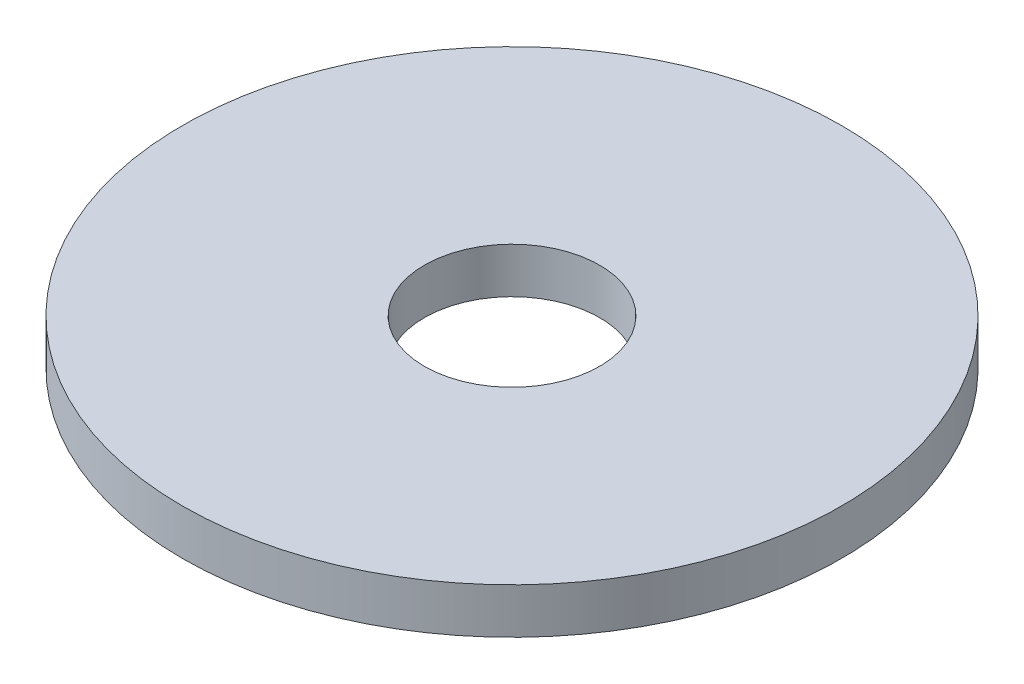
ISO-10303-21;
HEADER;
FILE_DESCRIPTION(('STEP AP214'),'2;1');
FILE_NAME('part.step','',(''),(''),'','','');
FILE_SCHEMA(('AUTOMOTIVE_DESIGN { 1 0 10303 214 1 1 1 1 }'));
ENDSEC;
DATA;
#1=APPLICATION_CONTEXT('core data for automotive mechanical design processes');
#2=APPLICATION_PROTOCOL_DEFINITION('international standard','automotive_design',2000,#1);
#3=PRODUCT_CONTEXT('',#1,'mechanical');
#4=PRODUCT('Part','Part','',(#3));
#5=PRODUCT_RELATED_PRODUCT_CATEGORY('part','',(#4));
#6=PRODUCT_DEFINITION_FORMATION('','',#4);
#7=PRODUCT_DEFINITION_CONTEXT('part definition',#1,'design');
#8=PRODUCT_DEFINITION('design','',#6,#7);
#9=PRODUCT_DEFINITION_SHAPE('','',#8);
#10=(LENGTH_UNIT() NAMED_UNIT(*) SI_UNIT(.MILLI.,.METRE.));
#11=(NAMED_UNIT(*) PLANE_ANGLE_UNIT() SI_UNIT($,.RADIAN.));
#12=(NAMED_UNIT(*) SI_UNIT($,.STERADIAN.) SOLID_ANGLE_UNIT());
#13=UNCERTAINTY_MEASURE_WITH_UNIT(LENGTH_MEASURE(1.E-05),#10,'distance_accuracy_value','');
#14=(GEOMETRIC_REPRESENTATION_CONTEXT(3) GLOBAL_UNCERTAINTY_ASSIGNED_CONTEXT((#13)) GLOBAL_UNIT_ASSIGNED_CONTEXT((#10,
#11,#12)) REPRESENTATION_CONTEXT('',''));
#15=CARTESIAN_POINT('',(0.,0.,0.));
#16=DIRECTION('',(0.,0.,1.));
#17=DIRECTION('',(1.,0.,0.));
#18=AXIS2_PLACEMENT_3D('',#15,#16,#17);
#19=CARTESIAN_POINT('',(0.,1.7526,0.));
#20=DIRECTION('',(0.,-1.,0.));
#21=DIRECTION('',(0.,0.,-1.));
#22=AXIS2_PLACEMENT_3D('',#19,#20,#21);
#23=CYLINDRICAL_SURFACE('',#22,12.7);
#24=CARTESIAN_POINT('',(0.,1.7526,0.));
#25=DIRECTION('',(0.,1.,0.));
#26=DIRECTION('',(0.,0.,1.));
#27=AXIS2_PLACEMENT_3D('',#24,#25,#26);
#28=CIRCLE('',#27,12.7);
#29=CARTESIAN_POINT('',(0.,1.7526,12.7));
#30=VERTEX_POINT('',#29);
#31=EDGE_CURVE('E10',#30,#30,#28,.T.);
#32=ORIENTED_EDGE('',*,*,#31,.F.);
#33=EDGE_LOOP('',(#32));
#34=FACE_BOUND('',#33,.T.);
#35=CARTESIAN_POINT('',(0.,0.,0.));
#36=DIRECTION('',(0.,1.,0.));
#37=DIRECTION('',(0.,0.,1.));
#38=AXIS2_PLACEMENT_3D('',#35,#36,#37);
#39=CIRCLE('',#38,12.7);
#40=CARTESIAN_POINT('',(0.,0.,12.7));
#41=VERTEX_POINT('',#40);
#42=EDGE_CURVE('E33',#41,#41,#39,.T.);
#43=ORIENTED_EDGE('',*,*,#42,.T.);
#44=EDGE_LOOP('',(#43));
#45=FACE_BOUND('',#44,.T.);
#46=ADVANCED_FACE('F30',(#34,#45),#23,.T.);
#47=CARTESIAN_POINT('',(0.,1.7526,0.));
#48=DIRECTION('',(0.,1.,0.));
#49=DIRECTION('',(0.,0.,1.));
#50=AXIS2_PLACEMENT_3D('',#47,#48,#49);
#51=PLANE('',#50);
#52=CARTESIAN_POINT('',(0.,1.7526,0.));
#53=DIRECTION('',(0.,1.,0.));
#54=DIRECTION('',(0.,0.,1.));
#55=AXIS2_PLACEMENT_3D('',#52,#53,#54);
#56=CIRCLE('',#55,3.3782);
#57=CARTESIAN_POINT('',(0.,1.7526,3.3782));
#58=VERTEX_POINT('',#57);
#59=EDGE_CURVE('E42',#58,#58,#56,.T.);
#60=ORIENTED_EDGE('',*,*,#59,.F.);
#61=EDGE_LOOP('',(#60));
#62=FACE_BOUND('',#61,.T.);
#63=ORIENTED_EDGE('',*,*,#31,.T.);
#64=EDGE_LOOP('',(#63));
#65=FACE_BOUND('',#64,.T.);
#66=ADVANCED_FACE('F57',(#62,#65),#51,.T.);
#67=CARTESIAN_POINT('',(0.,0.,0.));
#68=DIRECTION('',(0.,1.,0.));
#69=DIRECTION('',(0.,0.,1.));
#70=AXIS2_PLACEMENT_3D('',#67,#68,#69);
#71=PLANE('',#70);
#72=CARTESIAN_POINT('',(0.,0.,0.));
#73=DIRECTION('',(0.,1.,0.));
#74=DIRECTION('',(0.,0.,1.));
#75=AXIS2_PLACEMENT_3D('',#72,#73,#74);
#76=CIRCLE('',#75,3.3782);
#77=CARTESIAN_POINT('',(0.,0.,3.3782));
#78=VERTEX_POINT('',#77);
#79=EDGE_CURVE('E40',#78,#78,#76,.T.);
#80=ORIENTED_EDGE('',*,*,#79,.T.);
#81=EDGE_LOOP('',(#80));
#82=FACE_BOUND('',#81,.T.);
#83=ORIENTED_EDGE('',*,*,#42,.F.);
#84=EDGE_LOOP('',(#83));
#85=FACE_BOUND('',#84,.T.);
#86=ADVANCED_FACE('F48',(#82,#85),#71,.F.);
#87=CARTESIAN_POINT('',(0.,0.,0.));
#88=DIRECTION('',(0.,1.,0.));
#89=DIRECTION('',(0.,0.,1.));
#90=AXIS2_PLACEMENT_3D('',#87,#88,#89);
#91=CYLINDRICAL_SURFACE('',#90,3.3782);
#92=ORIENTED_EDGE('',*,*,#79,.F.);
#93=EDGE_LOOP('',(#92));
#94=FACE_BOUND('',#93,.T.);
#95=ORIENTED_EDGE('',*,*,#59,.T.);
#96=EDGE_LOOP('',(#95));
#97=FACE_BOUND('',#96,.T.);
#98=ADVANCED_FACE('F51',(#94,#97),#91,.F.);
#99=CLOSED_SHELL('',(#46,#66,#86,#98));
#100=MANIFOLD_SOLID_BREP('B2',#99);
#101=ADVANCED_BREP_SHAPE_REPRESENTATION('',(#18,#100),#14);
#102=SHAPE_DEFINITION_REPRESENTATION(#9,#101);
ENDSEC;
END-ISO-10303-21;
